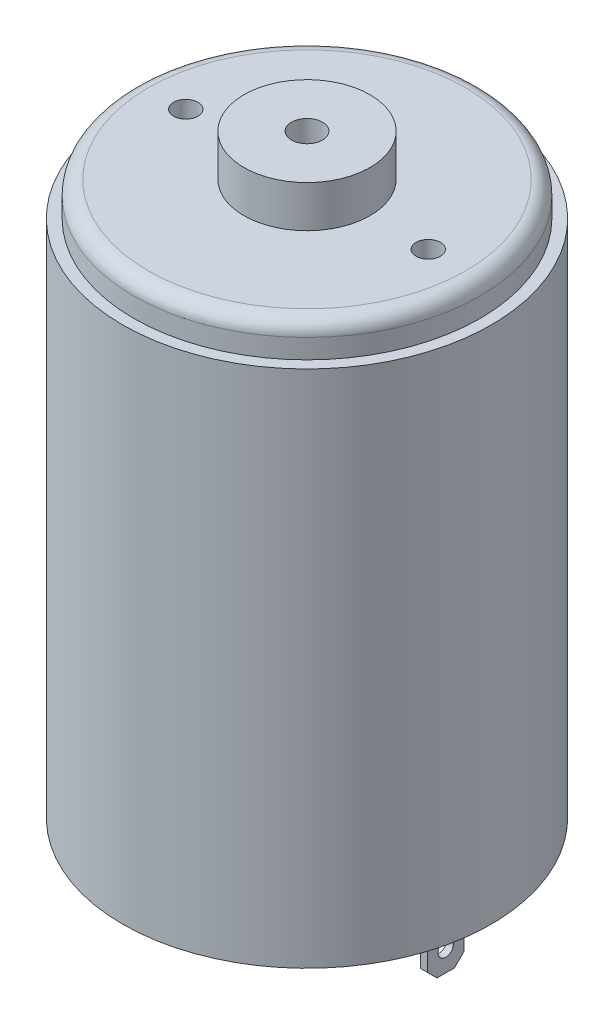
from build123d import *

# Parameters (mm, degrees)
ENL_V_MAT_EXTRU_1_DEPTH                   = 15
TROU_TARAUD_M31_D                         = 2.5
TROU_TARAUD_M31_DEPTH                     = 8.5
TROU_TARAUD_M31_TIP                       = 0.751075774
ESQUISSE5_W                               = 0.7
ESQUISSE5_H                               = 3.8
BOSS_EXTRU_1_DEPTH                        = 6.7
CHANFREIN1_SIZE                           = 1
ESQUISSE6_R                               = 0.8
ENL_V_MAT_EXTRU_2_DEPTH                   = 6.7
R_P_TITION_CIRCULAIRE1_COUNT              = 2
CHANFREIN1_OF_R_P_TITION_CIRCULAIRE1_SIZE = 1
ESQUISSE7_R                               = 1.6
ENL_V_MAT_EXTRU_3_DEPTH                   = 90.145947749


with BuildPart() as part:
    # Esquisse1 → R_volution1 (revolve)
    with BuildSketch(Plane.XY, mode=Mode.PRIVATE) as r_volution1_sk:
        with BuildLine():
            Line((0, 0), (-1.6, 0))
            Line((-1.6, 0), (-1.6, 2.6))
            Line((-1.6, 2.6), (-5.075, 2.6))
            Line((-5.075, 2.6), (-5.075, 4.5))
            Line((-5.075, 4.5), (-19, 4.5))
            Line((-19, 4.5), (-19, 58))
            Line((-19, 58), (-17.85, 58))
            Line((-17.85, 58), (-17.85, 60))
            ThreePointArc((-17.85, 60), (-17.410660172, 61.060660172), (-16.35, 61.5))
            Line((-16.35, 61.5), (-6.5, 61.5))
            Line((-6.5, 61.5), (-6.5, 65.8))
            Line((-6.5, 65.8), (-1.6, 65.8))
            Line((-1.6, 65.8), (-1.6, 85))
            Line((-1.6, 85), (0, 85))
            Line((0, 85), (0, 0))
        make_face()
    revolve(r_volution1_sk.sketch.rotate(Axis((0, 0, 0), (0, 1, 0)), 270), axis=Axis((0, 0, 0), (0, 1, 0)))

    # Esquisse2 → Enl_v. mat.-Extru.1 (cut)
    with BuildSketch(Plane(origin=(0, 85, 0), x_dir=(1, 0, 0), z_dir=(0, 1, 0))):
        with BuildLine():
            Line((-1.161895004, -1.1), (1.161895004, -1.1))
            ThreePointArc((1.161895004, -1.1), (0, -1.6), (-1.161895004, -1.1))
        make_face()
    extrude(amount=-ENL_V_MAT_EXTRU_1_DEPTH, mode=Mode.SUBTRACT)

    # Trou taraud_ M31
    with Locations(Plane(origin=(0, 61.5, 0), x_dir=(-1, 0, 0), z_dir=(0, 1, 0))):
        with Locations((12.5, 0), (-12.5, 0)):
            Hole(TROU_TARAUD_M31_D / 2, depth=TROU_TARAUD_M31_DEPTH)
            with Locations((0, 0, -(TROU_TARAUD_M31_DEPTH + TROU_TARAUD_M31_TIP / 2))):  # 118° drill point
                Cone(0, TROU_TARAUD_M31_D / 2, TROU_TARAUD_M31_TIP, mode=Mode.SUBTRACT)

    # Esquisse5 → Boss.-Extru.1 (add)
    with BuildSketch(Plane.XZ.offset(-4.5)):
        with Locations((-13.95, 0)):
            Rectangle(ESQUISSE5_W, ESQUISSE5_H)
    boss_extru_1 = extrude(amount=BOSS_EXTRU_1_DEPTH)

    # Chanfrein1
    chanfrein1_edges = [part.edges().sort_by_distance(p)[0] for p in [
        (-13.95, -2.2, -1.9),
        (-13.95, -2.2, 1.9),
    ]]
    chamfer(chanfrein1_edges, length=CHANFREIN1_SIZE)

    # Esquisse6 → Enl_v. mat.-Extru.2 (cut)
    with BuildSketch(Plane.ZY.offset(14.3)):
        Circle(ESQUISSE6_R)
    enl_v_mat_extru_2 = extrude(amount=-ENL_V_MAT_EXTRU_2_DEPTH, mode=Mode.SUBTRACT)

    # R_p_tition circulaire1: Boss.-Extru.1, Enl_v. mat.-Extru.2 ×2 about axis
    r_p_tition_circulaire1_axis = Axis((0, 0, 0), (0, 1, 0))
    add([boss_extru_1.rotate(r_p_tition_circulaire1_axis, i * 360 / R_P_TITION_CIRCULAIRE1_COUNT) for i in range(1, R_P_TITION_CIRCULAIRE1_COUNT)])
    add([enl_v_mat_extru_2.rotate(r_p_tition_circulaire1_axis, i * 360 / R_P_TITION_CIRCULAIRE1_COUNT) for i in range(1, R_P_TITION_CIRCULAIRE1_COUNT)], mode=Mode.SUBTRACT)

    # Chanfrein1 of R_p_tition circulaire1
    chanfrein1_of_r_p_tition_circulaire1_edges = [part.edges().sort_by_distance(p)[0] for p in [
        (13.95, -2.2, 1.9),
        (13.95, -2.2, -1.9),
    ]]
    chamfer(chanfrein1_of_r_p_tition_circulaire1_edges, length=CHANFREIN1_OF_R_P_TITION_CIRCULAIRE1_SIZE)

    # Esquisse7 → Enl_v. mat.-Extru.3 (cut, through all)
    with BuildSketch(Plane.XZ):
        with Locations(Location((0, 0, 0), (0, 0, 270))):
            Circle(ESQUISSE7_R)
    extrude(amount=-ENL_V_MAT_EXTRU_3_DEPTH, mode=Mode.SUBTRACT)


solid = part.part
